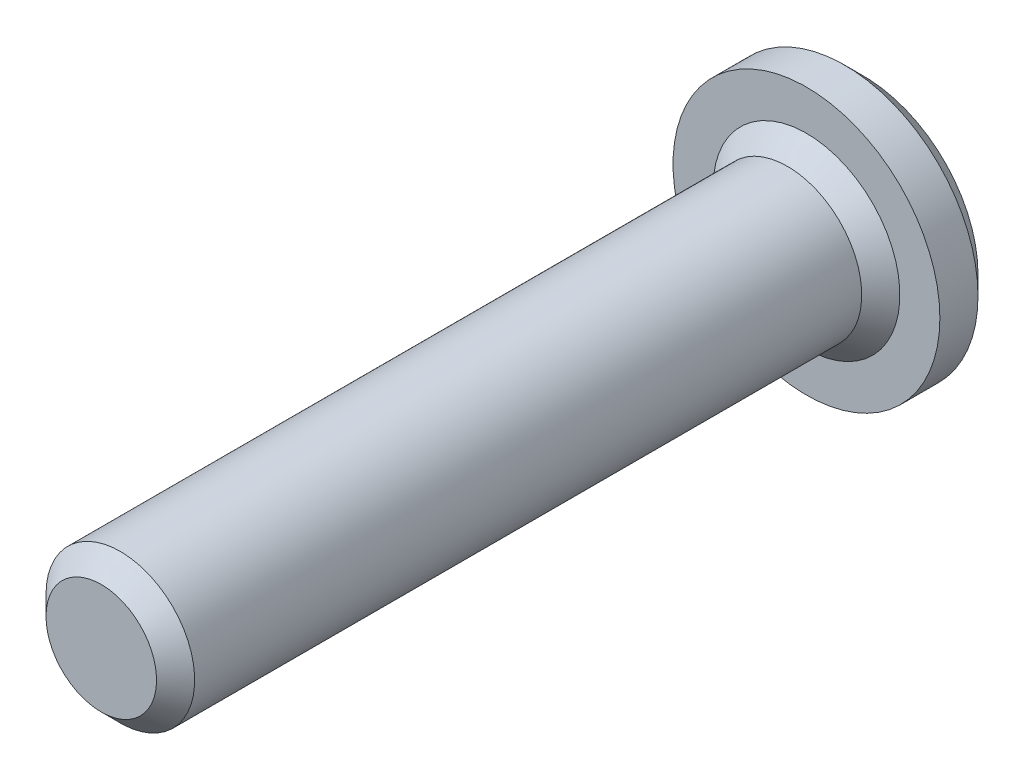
ISO-10303-21;
HEADER;
FILE_DESCRIPTION(('STEP AP214'),'2;1');
FILE_NAME('part.step','',(''),(''),'','','');
FILE_SCHEMA(('AUTOMOTIVE_DESIGN { 1 0 10303 214 1 1 1 1 }'));
ENDSEC;
DATA;
#1=APPLICATION_CONTEXT('core data for automotive mechanical design processes');
#2=APPLICATION_PROTOCOL_DEFINITION('international standard','automotive_design',2000,#1);
#3=PRODUCT_CONTEXT('',#1,'mechanical');
#4=PRODUCT('Part','Part','',(#3));
#5=PRODUCT_RELATED_PRODUCT_CATEGORY('part','',(#4));
#6=PRODUCT_DEFINITION_FORMATION('','',#4);
#7=PRODUCT_DEFINITION_CONTEXT('part definition',#1,'design');
#8=PRODUCT_DEFINITION('design','',#6,#7);
#9=PRODUCT_DEFINITION_SHAPE('','',#8);
#10=(LENGTH_UNIT() NAMED_UNIT(*) SI_UNIT(.MILLI.,.METRE.));
#11=(NAMED_UNIT(*) PLANE_ANGLE_UNIT() SI_UNIT($,.RADIAN.));
#12=(NAMED_UNIT(*) SI_UNIT($,.STERADIAN.) SOLID_ANGLE_UNIT());
#13=UNCERTAINTY_MEASURE_WITH_UNIT(LENGTH_MEASURE(1.E-05),#10,'distance_accuracy_value','');
#14=(GEOMETRIC_REPRESENTATION_CONTEXT(3) GLOBAL_UNCERTAINTY_ASSIGNED_CONTEXT((#13)) GLOBAL_UNIT_ASSIGNED_CONTEXT((#10,
#11,#12)) REPRESENTATION_CONTEXT('',''));
#15=CARTESIAN_POINT('',(0.,0.,0.));
#16=DIRECTION('',(0.,0.,1.));
#17=DIRECTION('',(1.,0.,0.));
#18=AXIS2_PLACEMENT_3D('',#15,#16,#17);
#19=CARTESIAN_POINT('',(0.,0.,37.));
#20=DIRECTION('',(0.,0.,1.));
#21=DIRECTION('',(1.,0.,0.));
#22=AXIS2_PLACEMENT_3D('',#19,#20,#21);
#23=CYLINDRICAL_SURFACE('',#22,7.);
#24=CARTESIAN_POINT('',(0.,0.,-2.00000000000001));
#25=DIRECTION('',(0.,0.,1.));
#26=DIRECTION('',(1.,0.,0.));
#27=AXIS2_PLACEMENT_3D('',#24,#25,#26);
#28=CIRCLE('',#27,7.);
#29=CARTESIAN_POINT('',(7.00000000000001,0.,-2.00000000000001));
#30=VERTEX_POINT('',#29);
#31=EDGE_CURVE('E40',#30,#30,#28,.T.);
#32=ORIENTED_EDGE('',*,*,#31,.T.);
#33=EDGE_LOOP('',(#32));
#34=FACE_BOUND('',#33,.T.);
#35=CARTESIAN_POINT('',(0.,0.,0.));
#36=DIRECTION('',(0.,0.,1.));
#37=DIRECTION('',(1.,0.,0.));
#38=AXIS2_PLACEMENT_3D('',#35,#36,#37);
#39=CIRCLE('',#38,7.);
#40=CARTESIAN_POINT('',(7.00000000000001,0.,0.));
#41=VERTEX_POINT('',#40);
#42=EDGE_CURVE('E59',#41,#41,#39,.T.);
#43=ORIENTED_EDGE('',*,*,#42,.F.);
#44=EDGE_LOOP('',(#43));
#45=FACE_BOUND('',#44,.T.);
#46=ADVANCED_FACE('F33',(#34,#45),#23,.T.);
#47=CARTESIAN_POINT('',(-7.,0.,-3.));
#48=DIRECTION('',(0.,0.,1.));
#49=DIRECTION('',(1.,0.,0.));
#50=AXIS2_PLACEMENT_3D('',#47,#48,#49);
#51=PLANE('',#50);
#52=CARTESIAN_POINT('',(0.,0.,-3.));
#53=DIRECTION('',(0.,0.,1.));
#54=DIRECTION('',(1.,0.,0.));
#55=AXIS2_PLACEMENT_3D('',#52,#53,#54);
#56=CIRCLE('',#55,6.);
#57=CARTESIAN_POINT('',(6.00000000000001,0.,-3.));
#58=VERTEX_POINT('',#57);
#59=EDGE_CURVE('E10',#58,#58,#56,.F.);
#60=ORIENTED_EDGE('',*,*,#59,.T.);
#61=EDGE_LOOP('',(#60));
#62=FACE_BOUND('',#61,.T.);
#63=ADVANCED_FACE('F66',(#62),#51,.F.);
#64=CARTESIAN_POINT('',(-3.9,0.,37.));
#65=DIRECTION('',(0.,0.,-1.));
#66=DIRECTION('',(-1.,0.,0.));
#67=AXIS2_PLACEMENT_3D('',#64,#65,#66);
#68=PLANE('',#67);
#69=CARTESIAN_POINT('',(0.,0.,37.));
#70=DIRECTION('',(0.,0.,-1.));
#71=DIRECTION('',(-1.,0.,0.));
#72=AXIS2_PLACEMENT_3D('',#69,#70,#71);
#73=CIRCLE('',#72,2.9);
#74=CARTESIAN_POINT('',(-2.9,0.,37.));
#75=VERTEX_POINT('',#74);
#76=EDGE_CURVE('E44',#75,#75,#73,.F.);
#77=ORIENTED_EDGE('',*,*,#76,.T.);
#78=EDGE_LOOP('',(#77));
#79=FACE_BOUND('',#78,.T.);
#80=ADVANCED_FACE('F71',(#79),#68,.F.);
#81=CARTESIAN_POINT('',(0.,0.,37.));
#82=DIRECTION('',(0.,0.,1.));
#83=DIRECTION('',(1.,0.,0.));
#84=AXIS2_PLACEMENT_3D('',#81,#82,#83);
#85=CYLINDRICAL_SURFACE('',#84,3.9);
#86=CARTESIAN_POINT('',(0.,0.,1.00000000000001));
#87=DIRECTION('',(0.,0.,-1.));
#88=DIRECTION('',(-1.,0.,0.));
#89=AXIS2_PLACEMENT_3D('',#86,#87,#88);
#90=CIRCLE('',#89,3.9);
#91=CARTESIAN_POINT('',(-3.9,0.,1.00000000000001));
#92=VERTEX_POINT('',#91);
#93=EDGE_CURVE('E53',#92,#92,#90,.F.);
#94=ORIENTED_EDGE('',*,*,#93,.T.);
#95=EDGE_LOOP('',(#94));
#96=FACE_BOUND('',#95,.T.);
#97=CARTESIAN_POINT('',(0.,0.,36.));
#98=DIRECTION('',(0.,0.,-1.));
#99=DIRECTION('',(-1.,0.,0.));
#100=AXIS2_PLACEMENT_3D('',#97,#98,#99);
#101=CIRCLE('',#100,3.9);
#102=CARTESIAN_POINT('',(-3.9,0.,36.));
#103=VERTEX_POINT('',#102);
#104=EDGE_CURVE('E56',#103,#103,#101,.T.);
#105=ORIENTED_EDGE('',*,*,#104,.T.);
#106=EDGE_LOOP('',(#105));
#107=FACE_BOUND('',#106,.T.);
#108=ADVANCED_FACE('F90',(#96,#107),#85,.T.);
#109=CARTESIAN_POINT('',(-7.,0.,0.));
#110=DIRECTION('',(0.,0.,-1.));
#111=DIRECTION('',(-1.,0.,0.));
#112=AXIS2_PLACEMENT_3D('',#109,#110,#111);
#113=PLANE('',#112);
#114=CARTESIAN_POINT('',(0.,0.,0.));
#115=DIRECTION('',(0.,0.,-1.));
#116=DIRECTION('',(-1.,0.,0.));
#117=AXIS2_PLACEMENT_3D('',#114,#115,#116);
#118=CIRCLE('',#117,4.9);
#119=CARTESIAN_POINT('',(-4.9,0.,0.));
#120=VERTEX_POINT('',#119);
#121=EDGE_CURVE('E48',#120,#120,#118,.T.);
#122=ORIENTED_EDGE('',*,*,#121,.T.);
#123=EDGE_LOOP('',(#122));
#124=FACE_BOUND('',#123,.T.);
#125=ORIENTED_EDGE('',*,*,#42,.T.);
#126=EDGE_LOOP('',(#125));
#127=FACE_BOUND('',#126,.T.);
#128=ADVANCED_FACE('F63',(#124,#127),#113,.F.);
#129=CARTESIAN_POINT('',(0.,0.,1.00000000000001));
#130=DIRECTION('',(0.,0.,-1.));
#131=DIRECTION('',(-1.,0.,0.));
#132=AXIS2_PLACEMENT_3D('',#129,#130,#131);
#133=CONICAL_SURFACE('',#132,3.9,0.785398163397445);
#134=ORIENTED_EDGE('',*,*,#121,.F.);
#135=EDGE_LOOP('',(#134));
#136=FACE_BOUND('',#135,.T.);
#137=ORIENTED_EDGE('',*,*,#93,.F.);
#138=EDGE_LOOP('',(#137));
#139=FACE_BOUND('',#138,.T.);
#140=ADVANCED_FACE('F75',(#136,#139),#133,.T.);
#141=CARTESIAN_POINT('',(0.,0.,37.));
#142=DIRECTION('',(0.,0.,-1.));
#143=DIRECTION('',(-1.,0.,0.));
#144=AXIS2_PLACEMENT_3D('',#141,#142,#143);
#145=CONICAL_SURFACE('',#144,2.9,0.785398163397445);
#146=ORIENTED_EDGE('',*,*,#104,.F.);
#147=EDGE_LOOP('',(#146));
#148=FACE_BOUND('',#147,.T.);
#149=ORIENTED_EDGE('',*,*,#76,.F.);
#150=EDGE_LOOP('',(#149));
#151=FACE_BOUND('',#150,.T.);
#152=ADVANCED_FACE('F77',(#148,#151),#145,.T.);
#153=CARTESIAN_POINT('',(0.,0.,-2.00000000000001));
#154=DIRECTION('',(0.,0.,1.));
#155=DIRECTION('',(1.,0.,0.));
#156=AXIS2_PLACEMENT_3D('',#153,#154,#155);
#157=CONICAL_SURFACE('',#156,7.,0.785398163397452);
#158=ORIENTED_EDGE('',*,*,#59,.F.);
#159=EDGE_LOOP('',(#158));
#160=FACE_BOUND('',#159,.T.);
#161=ORIENTED_EDGE('',*,*,#31,.F.);
#162=EDGE_LOOP('',(#161));
#163=FACE_BOUND('',#162,.T.);
#164=ADVANCED_FACE('F35',(#160,#163),#157,.T.);
#165=CLOSED_SHELL('',(#46,#63,#80,#108,#128,#140,#152,#164));
#166=MANIFOLD_SOLID_BREP('B2',#165);
#167=ADVANCED_BREP_SHAPE_REPRESENTATION('',(#18,#166),#14);
#168=SHAPE_DEFINITION_REPRESENTATION(#9,#167);
ENDSEC;
END-ISO-10303-21;
